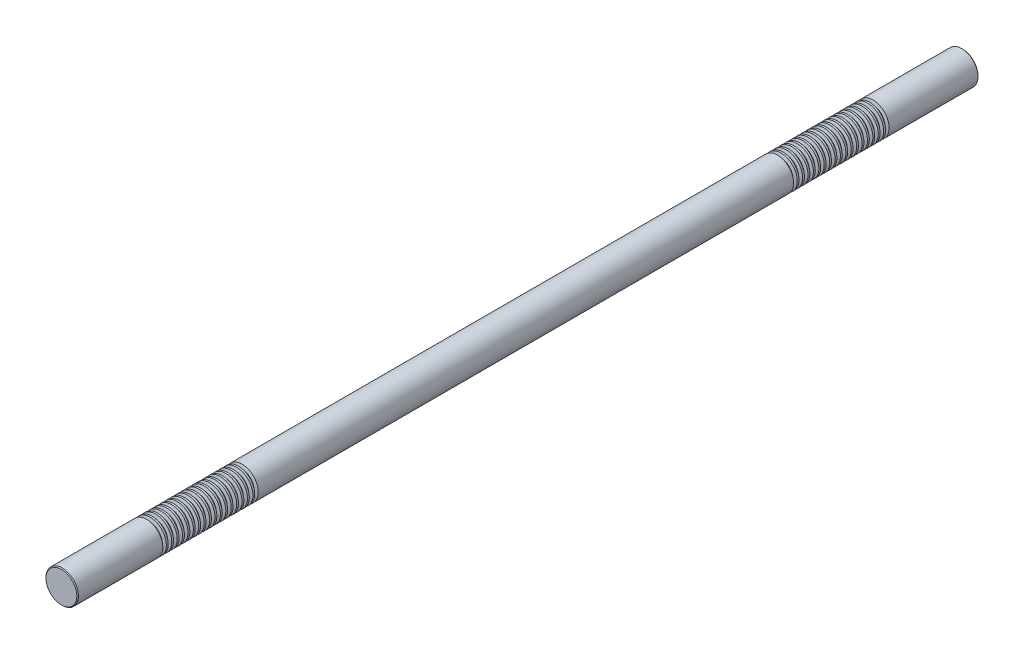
from build123d import *

# Parameters (mm, degrees)
SKETCH1_R           = 18
BOSS_EXTRUDE1_DEPTH = 500
CHAMFER1_SIZE       = 0.9
LPATTERN1_COUNT     = 18
LPATTERN1_PITCH     = 6
LPATTERN2_COUNT     = 2
LPATTERN2_PITCH     = 700


with BuildPart() as part:
    # Sketch1 → Boss-Extrude1 (new, symmetric)
    with BuildSketch(Plane.XY):
        Circle(SKETCH1_R)
    extrude(amount=BOSS_EXTRUDE1_DEPTH, both=True)

    # Chamfer1
    chamfer1_edges = [part.edges().sort_by_distance(p)[0] for p in [
        (-18, 0, -500),
        (-18, 0, 500),
    ]]
    chamfer(chamfer1_edges, length=CHAMFER1_SIZE)

    # Sketch2 → Cut-Revolve1 (revolve, cut)
    with BuildSketch(Plane(origin=(0, 0, 0), x_dir=(0, 0, -1), z_dir=(1, 0, 0)), mode=Mode.PRIVATE) as cut_revolve1_sk:
        Polygon((400.468911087, 18), (396.531088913, 18), (397.468911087, 14.5), (399.531088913, 14.5), align=None)
    cut_revolve1 = revolve(cut_revolve1_sk.sketch.rotate(Axis((0, 0, 500), (0, 0, -1)), 90), axis=Axis((0, 0, 500), (0, 0, -1)), mode=Mode.SUBTRACT)

    # LPattern1: Cut-Revolve1 ×18
    with Locations(*[(0, 0, i * LPATTERN1_PITCH) for i in range(1, LPATTERN1_COUNT)]):
        add(cut_revolve1, mode=Mode.SUBTRACT)

    # LPattern2: Cut-Revolve1 ×2
    with Locations(*[(0, 0, i * LPATTERN2_PITCH) for i in range(1, LPATTERN2_COUNT)]):
        add(cut_revolve1, mode=Mode.SUBTRACT)

    # LPattern2 copy 1 sketch → LPattern2 copy 1 (revolve, cut)
    with BuildSketch(Plane(origin=(0, 0, 706), x_dir=(0, 0, -1), z_dir=(1, 0, 0))):
        Polygon((400.468911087, 18), (396.531088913, 18), (397.468911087, 14.5), (399.531088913, 14.5), align=None)
    revolve(axis=Axis((0, 0, 1206), (0, 0, -1)), mode=Mode.SUBTRACT)

    # LPattern2 copy 2 sketch → LPattern2 copy 2 (revolve, cut)
    with BuildSketch(Plane(origin=(0, 0, 712), x_dir=(0, 0, -1), z_dir=(1, 0, 0))):
        Polygon((400.468911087, 18), (396.531088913, 18), (397.468911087, 14.5), (399.531088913, 14.5), align=None)
    revolve(axis=Axis((0, 0, 1212), (0, 0, -1)), mode=Mode.SUBTRACT)

    # LPattern2 copy 3 sketch → LPattern2 copy 3 (revolve, cut)
    with BuildSketch(Plane(origin=(0, 0, 718), x_dir=(0, 0, -1), z_dir=(1, 0, 0))):
        Polygon((400.468911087, 18), (396.531088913, 18), (397.468911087, 14.5), (399.531088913, 14.5), align=None)
    revolve(axis=Axis((0, 0, 1218), (0, 0, -1)), mode=Mode.SUBTRACT)

    # LPattern2 copy 4 sketch → LPattern2 copy 4 (revolve, cut)
    with BuildSketch(Plane(origin=(0, 0, 724), x_dir=(0, 0, -1), z_dir=(1, 0, 0))):
        Polygon((400.468911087, 18), (396.531088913, 18), (397.468911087, 14.5), (399.531088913, 14.5), align=None)
    revolve(axis=Axis((0, 0, 1224), (0, 0, -1)), mode=Mode.SUBTRACT)

    # LPattern2 copy 5 sketch → LPattern2 copy 5 (revolve, cut)
    with BuildSketch(Plane(origin=(0, 0, 730), x_dir=(0, 0, -1), z_dir=(1, 0, 0))):
        Polygon((400.468911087, 18), (396.531088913, 18), (397.468911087, 14.5), (399.531088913, 14.5), align=None)
    revolve(axis=Axis((0, 0, 1230), (0, 0, -1)), mode=Mode.SUBTRACT)

    # LPattern2 copy 6 sketch → LPattern2 copy 6 (revolve, cut)
    with BuildSketch(Plane(origin=(0, 0, 736), x_dir=(0, 0, -1), z_dir=(1, 0, 0))):
        Polygon((400.468911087, 18), (396.531088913, 18), (397.468911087, 14.5), (399.531088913, 14.5), align=None)
    revolve(axis=Axis((0, 0, 1236), (0, 0, -1)), mode=Mode.SUBTRACT)

    # LPattern2 copy 7 sketch → LPattern2 copy 7 (revolve, cut)
    with BuildSketch(Plane(origin=(0, 0, 742), x_dir=(0, 0, -1), z_dir=(1, 0, 0))):
        Polygon((400.468911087, 18), (396.531088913, 18), (397.468911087, 14.5), (399.531088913, 14.5), align=None)
    revolve(axis=Axis((0, 0, 1242), (0, 0, -1)), mode=Mode.SUBTRACT)

    # LPattern2 copy 8 sketch → LPattern2 copy 8 (revolve, cut)
    with BuildSketch(Plane(origin=(0, 0, 748), x_dir=(0, 0, -1), z_dir=(1, 0, 0))):
        Polygon((400.468911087, 18), (396.531088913, 18), (397.468911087, 14.5), (399.531088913, 14.5), align=None)
    revolve(axis=Axis((0, 0, 1248), (0, 0, -1)), mode=Mode.SUBTRACT)

    # LPattern2 copy 9 sketch → LPattern2 copy 9 (revolve, cut)
    with BuildSketch(Plane(origin=(0, 0, 754), x_dir=(0, 0, -1), z_dir=(1, 0, 0))):
        Polygon((400.468911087, 18), (396.531088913, 18), (397.468911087, 14.5), (399.531088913, 14.5), align=None)
    revolve(axis=Axis((0, 0, 1254), (0, 0, -1)), mode=Mode.SUBTRACT)

    # LPattern2 copy 10 sketch → LPattern2 copy 10 (revolve, cut)
    with BuildSketch(Plane(origin=(0, 0, 760), x_dir=(0, 0, -1), z_dir=(1, 0, 0))):
        Polygon((400.468911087, 18), (396.531088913, 18), (397.468911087, 14.5), (399.531088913, 14.5), align=None)
    revolve(axis=Axis((0, 0, 1260), (0, 0, -1)), mode=Mode.SUBTRACT)

    # LPattern2 copy 11 sketch → LPattern2 copy 11 (revolve, cut)
    with BuildSketch(Plane(origin=(0, 0, 766), x_dir=(0, 0, -1), z_dir=(1, 0, 0))):
        Polygon((400.468911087, 18), (396.531088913, 18), (397.468911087, 14.5), (399.531088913, 14.5), align=None)
    revolve(axis=Axis((0, 0, 1266), (0, 0, -1)), mode=Mode.SUBTRACT)

    # LPattern2 copy 12 sketch → LPattern2 copy 12 (revolve, cut)
    with BuildSketch(Plane(origin=(0, 0, 772), x_dir=(0, 0, -1), z_dir=(1, 0, 0))):
        Polygon((400.468911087, 18), (396.531088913, 18), (397.468911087, 14.5), (399.531088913, 14.5), align=None)
    revolve(axis=Axis((0, 0, 1272), (0, 0, -1)), mode=Mode.SUBTRACT)

    # LPattern2 copy 13 sketch → LPattern2 copy 13 (revolve, cut)
    with BuildSketch(Plane(origin=(0, 0, 778), x_dir=(0, 0, -1), z_dir=(1, 0, 0))):
        Polygon((400.468911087, 18), (396.531088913, 18), (397.468911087, 14.5), (399.531088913, 14.5), align=None)
    revolve(axis=Axis((0, 0, 1278), (0, 0, -1)), mode=Mode.SUBTRACT)

    # LPattern2 copy 14 sketch → LPattern2 copy 14 (revolve, cut)
    with BuildSketch(Plane(origin=(0, 0, 784), x_dir=(0, 0, -1), z_dir=(1, 0, 0))):
        Polygon((400.468911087, 18), (396.531088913, 18), (397.468911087, 14.5), (399.531088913, 14.5), align=None)
    revolve(axis=Axis((0, 0, 1284), (0, 0, -1)), mode=Mode.SUBTRACT)

    # LPattern2 copy 15 sketch → LPattern2 copy 15 (revolve, cut)
    with BuildSketch(Plane(origin=(0, 0, 790), x_dir=(0, 0, -1), z_dir=(1, 0, 0))):
        Polygon((400.468911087, 18), (396.531088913, 18), (397.468911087, 14.5), (399.531088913, 14.5), align=None)
    revolve(axis=Axis((0, 0, 1290), (0, 0, -1)), mode=Mode.SUBTRACT)

    # LPattern2 copy 16 sketch → LPattern2 copy 16 (revolve, cut)
    with BuildSketch(Plane(origin=(0, 0, 796), x_dir=(0, 0, -1), z_dir=(1, 0, 0))):
        Polygon((400.468911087, 18), (396.531088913, 18), (397.468911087, 14.5), (399.531088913, 14.5), align=None)
    revolve(axis=Axis((0, 0, 1296), (0, 0, -1)), mode=Mode.SUBTRACT)

    # LPattern2 copy 17 sketch → LPattern2 copy 17 (revolve, cut)
    with BuildSketch(Plane(origin=(0, 0, 802), x_dir=(0, 0, -1), z_dir=(1, 0, 0))):
        Polygon((400.468911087, 18), (396.531088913, 18), (397.468911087, 14.5), (399.531088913, 14.5), align=None)
    revolve(axis=Axis((0, 0, 1302), (0, 0, -1)), mode=Mode.SUBTRACT)


solid = part.part
